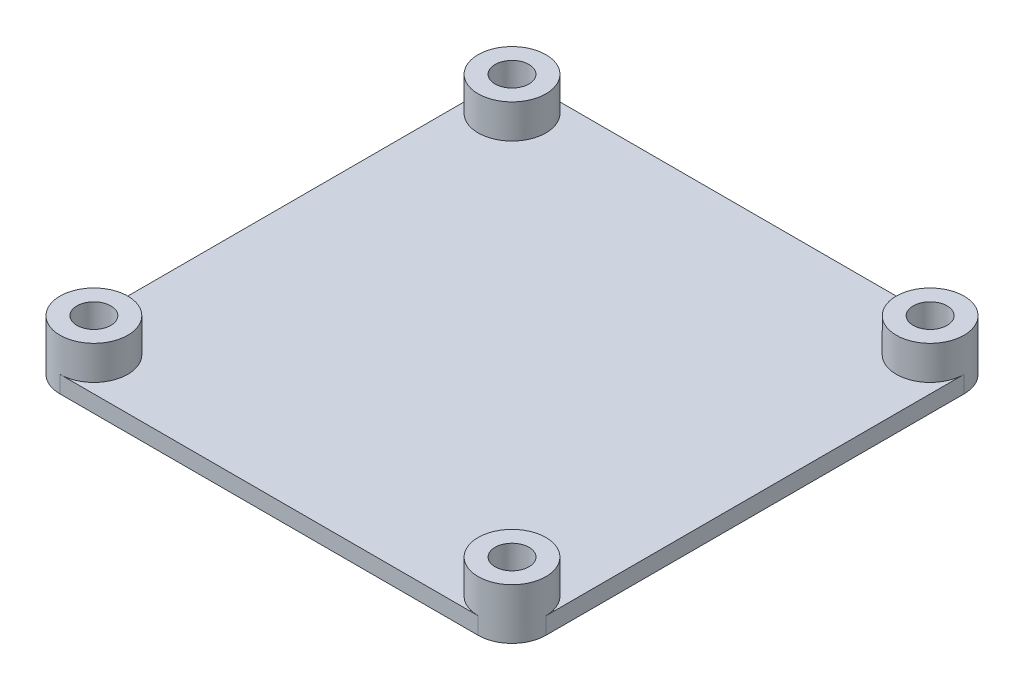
from build123d import *

# Parameters (mm, degrees)
BOSS_EXTRU_2_DEPTH      = 1.5
ESQUISSE3_R             = 3
BOSS_EXTRU_3_DEPTH      = 3
ESQUISSE4_R             = 1.5
ENL_V_MAT_EXTRU_1_DEPTH = 5
ESQUISSE5_R             = 1.5
ENL_V_MAT_EXTRU_2_DEPTH = 5
ESQUISSE6_R             = 1.5
ENL_V_MAT_EXTRU_3_DEPTH = 5
ESQUISSE7_R             = 1.5
ENL_V_MAT_EXTRU_4_DEPTH = 5


with BuildPart() as part:
    # Esquisse1 → Boss.-Extru.2 (new body)
    with BuildSketch(Plane(origin=(0, 0, 0), x_dir=(1, 0, 0), z_dir=(0, 1, 0))):
        with BuildLine():
            Line((-18.5, 21.5), (18.5, 21.5))
            ThreePointArc((18.5, 21.5), (20.62132, 20.62132), (21.5, 18.5))
            Line((21.5, 18.5), (21.5, -18.5))
            ThreePointArc((21.5, -18.5), (20.62132, -20.62132), (18.5, -21.5))
            Line((18.5, -21.5), (-18.5, -21.5))
            ThreePointArc((-18.5, -21.5), (-20.62132, -20.62132), (-21.5, -18.5))
            Line((-21.5, -18.5), (-21.5, 18.5))
            ThreePointArc((-21.5, 18.5), (-20.62132, 20.62132), (-18.5, 21.5))
        make_face()
    extrude(amount=BOSS_EXTRU_2_DEPTH)

    # Esquisse3 → Boss.-Extru.3 (add)
    with BuildSketch(Plane(origin=(0, 1.5, 0), x_dir=(1, 0, 0), z_dir=(0, 1, 0))):
        with Locations(Location((-18.5, 18.5, 0), (0, 0, 90))):
            Circle(ESQUISSE3_R)
        with Locations(Location((18.5, 18.5, 0), (0, 0, 90))):
            Circle(ESQUISSE3_R)
        with Locations(Location((18.5, -18.5, 0), (0, 0, 270))):
            Circle(ESQUISSE3_R)
        with Locations(Location((-18.5, -18.5, 0), (0, 0, 270))):
            Circle(ESQUISSE3_R)
    extrude(amount=BOSS_EXTRU_3_DEPTH)

    # Esquisse4 → Enl_v. mat.-Extru.1 (cut)
    with BuildSketch(Plane(origin=(0, 4.5, 0), x_dir=(1, 0, 0), z_dir=(0, 1, 0))):
        with Locations(Location((18.5, 18.5, 0), (0, 0, 270))):
            Circle(ESQUISSE4_R)
    extrude(amount=-ENL_V_MAT_EXTRU_1_DEPTH, mode=Mode.SUBTRACT)

    # Esquisse5 → Enl_v. mat.-Extru.2 (cut)
    with BuildSketch(Plane(origin=(0, 4.5, 0), x_dir=(1, 0, 0), z_dir=(0, 1, 0))):
        with Locations(Location((18.5, -18.5, 0), (0, 0, 270))):
            Circle(ESQUISSE5_R)
    extrude(amount=-ENL_V_MAT_EXTRU_2_DEPTH, mode=Mode.SUBTRACT)

    # Esquisse6 → Enl_v. mat.-Extru.3 (cut)
    with BuildSketch(Plane(origin=(0, 4.5, 0), x_dir=(1, 0, 0), z_dir=(0, 1, 0))):
        with Locations(Location((-18.5, 18.5, 0), (0, 0, 270))):
            Circle(ESQUISSE6_R)
    extrude(amount=-ENL_V_MAT_EXTRU_3_DEPTH, mode=Mode.SUBTRACT)

    # Esquisse7 → Enl_v. mat.-Extru.4 (cut)
    with BuildSketch(Plane(origin=(0, 4.5, 0), x_dir=(1, 0, 0), z_dir=(0, 1, 0))):
        with Locations(Location((-18.5, -18.5, 0), (0, 0, 270))):
            Circle(ESQUISSE7_R)
    extrude(amount=-ENL_V_MAT_EXTRU_4_DEPTH, mode=Mode.SUBTRACT)


solid = part.part
